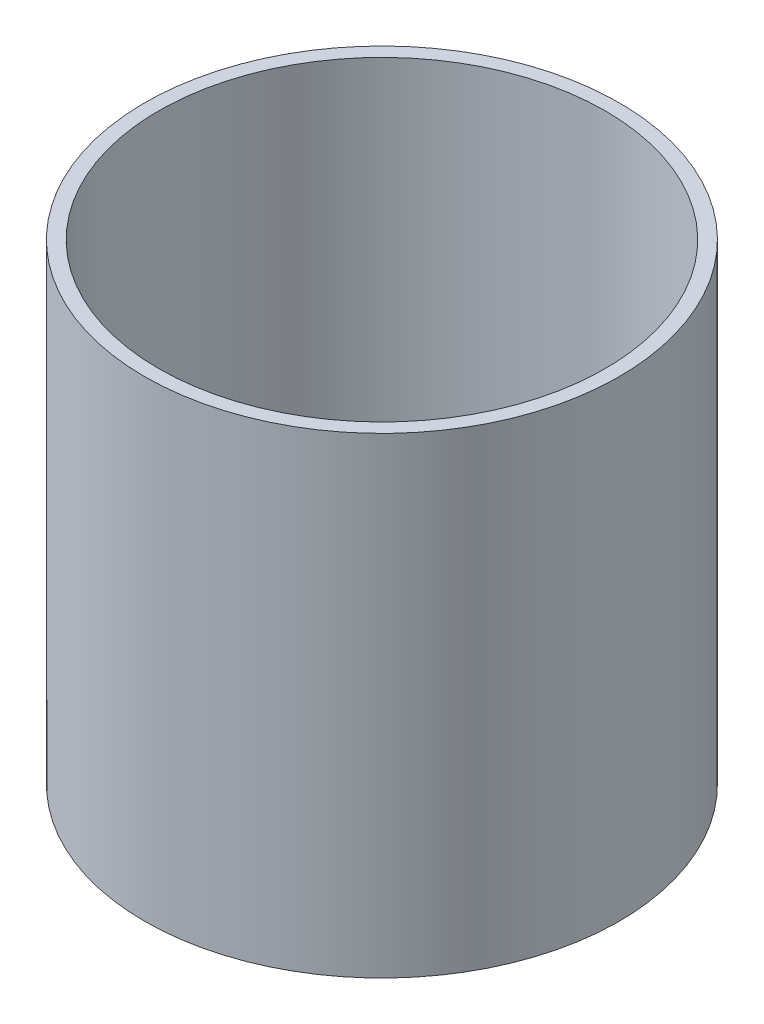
ISO-10303-21;
HEADER;
FILE_DESCRIPTION(('STEP AP214'),'2;1');
FILE_NAME('part.step','',(''),(''),'','','');
FILE_SCHEMA(('AUTOMOTIVE_DESIGN { 1 0 10303 214 1 1 1 1 }'));
ENDSEC;
DATA;
#1=APPLICATION_CONTEXT('core data for automotive mechanical design processes');
#2=APPLICATION_PROTOCOL_DEFINITION('international standard','automotive_design',2000,#1);
#3=PRODUCT_CONTEXT('',#1,'mechanical');
#4=PRODUCT('Part','Part','',(#3));
#5=PRODUCT_RELATED_PRODUCT_CATEGORY('part','',(#4));
#6=PRODUCT_DEFINITION_FORMATION('','',#4);
#7=PRODUCT_DEFINITION_CONTEXT('part definition',#1,'design');
#8=PRODUCT_DEFINITION('design','',#6,#7);
#9=PRODUCT_DEFINITION_SHAPE('','',#8);
#10=(LENGTH_UNIT() NAMED_UNIT(*) SI_UNIT(.MILLI.,.METRE.));
#11=(NAMED_UNIT(*) PLANE_ANGLE_UNIT() SI_UNIT($,.RADIAN.));
#12=(NAMED_UNIT(*) SI_UNIT($,.STERADIAN.) SOLID_ANGLE_UNIT());
#13=UNCERTAINTY_MEASURE_WITH_UNIT(LENGTH_MEASURE(1.E-05),#10,'distance_accuracy_value','');
#14=(GEOMETRIC_REPRESENTATION_CONTEXT(3) GLOBAL_UNCERTAINTY_ASSIGNED_CONTEXT((#13)) GLOBAL_UNIT_ASSIGNED_CONTEXT((#10,
#11,#12)) REPRESENTATION_CONTEXT('',''));
#15=CARTESIAN_POINT('',(0.,0.,0.));
#16=DIRECTION('',(0.,0.,1.));
#17=DIRECTION('',(1.,0.,0.));
#18=AXIS2_PLACEMENT_3D('',#15,#16,#17);
#19=CARTESIAN_POINT('',(0.,43.3301041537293,-850.));
#20=DIRECTION('',(0.,-1.,0.));
#21=DIRECTION('',(0.,0.,-1.));
#22=AXIS2_PLACEMENT_3D('',#19,#20,#21);
#23=PLANE('',#22);
#24=CARTESIAN_POINT('',(0.,43.3301041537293,0.));
#25=DIRECTION('',(0.,1.,0.));
#26=DIRECTION('',(0.,0.,1.));
#27=AXIS2_PLACEMENT_3D('',#24,#25,#26);
#28=CIRCLE('',#27,800.);
#29=CARTESIAN_POINT('',(0.,43.3301041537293,800.));
#30=VERTEX_POINT('',#29);
#31=EDGE_CURVE('E10',#30,#30,#28,.T.);
#32=ORIENTED_EDGE('',*,*,#31,.F.);
#33=EDGE_LOOP('',(#32));
#34=FACE_BOUND('',#33,.T.);
#35=CARTESIAN_POINT('',(0.,43.3301041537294,0.));
#36=DIRECTION('',(0.,1.,0.));
#37=DIRECTION('',(0.,0.,1.));
#38=AXIS2_PLACEMENT_3D('',#35,#36,#37);
#39=CIRCLE('',#38,850.);
#40=CARTESIAN_POINT('',(0.,43.3301041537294,850.));
#41=VERTEX_POINT('',#40);
#42=EDGE_CURVE('E45',#41,#41,#39,.T.);
#43=ORIENTED_EDGE('',*,*,#42,.T.);
#44=EDGE_LOOP('',(#43));
#45=FACE_BOUND('',#44,.T.);
#46=ADVANCED_FACE('F31',(#34,#45),#23,.F.);
#47=CARTESIAN_POINT('',(0.,0.,0.));
#48=DIRECTION('',(0.,1.,0.));
#49=DIRECTION('',(0.,0.,1.));
#50=AXIS2_PLACEMENT_3D('',#47,#48,#49);
#51=CYLINDRICAL_SURFACE('',#50,800.);
#52=CARTESIAN_POINT('',(0.,-1626.66989584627,0.));
#53=DIRECTION('',(0.,1.,0.));
#54=DIRECTION('',(0.,0.,1.));
#55=AXIS2_PLACEMENT_3D('',#52,#53,#54);
#56=CIRCLE('',#55,800.);
#57=CARTESIAN_POINT('',(0.,-1626.66989584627,800.));
#58=VERTEX_POINT('',#57);
#59=EDGE_CURVE('E37',#58,#58,#56,.T.);
#60=ORIENTED_EDGE('',*,*,#59,.F.);
#61=EDGE_LOOP('',(#60));
#62=FACE_BOUND('',#61,.T.);
#63=ORIENTED_EDGE('',*,*,#31,.T.);
#64=EDGE_LOOP('',(#63));
#65=FACE_BOUND('',#64,.T.);
#66=ADVANCED_FACE('F65',(#62,#65),#51,.F.);
#67=CARTESIAN_POINT('',(0.,-1626.66989584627,-1.96760314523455E-13));
#68=DIRECTION('',(0.,-1.,0.));
#69=DIRECTION('',(0.,0.,-1.));
#70=AXIS2_PLACEMENT_3D('',#67,#68,#69);
#71=PLANE('',#70);
#72=ORIENTED_EDGE('',*,*,#59,.T.);
#73=EDGE_LOOP('',(#72));
#74=FACE_BOUND('',#73,.T.);
#75=ADVANCED_FACE('F60',(#74),#71,.F.);
#76=CARTESIAN_POINT('',(0.,-1646.66989584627,-850.));
#77=DIRECTION('',(0.,1.,0.));
#78=DIRECTION('',(0.,0.,1.));
#79=AXIS2_PLACEMENT_3D('',#76,#77,#78);
#80=PLANE('',#79);
#81=CARTESIAN_POINT('',(0.,-1646.66989584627,0.));
#82=DIRECTION('',(0.,1.,0.));
#83=DIRECTION('',(0.,0.,1.));
#84=AXIS2_PLACEMENT_3D('',#81,#82,#83);
#85=CIRCLE('',#84,850.);
#86=CARTESIAN_POINT('',(0.,-1646.66989584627,850.));
#87=VERTEX_POINT('',#86);
#88=EDGE_CURVE('E41',#87,#87,#85,.T.);
#89=ORIENTED_EDGE('',*,*,#88,.F.);
#90=EDGE_LOOP('',(#89));
#91=FACE_BOUND('',#90,.T.);
#92=ADVANCED_FACE('F55',(#91),#80,.F.);
#93=CARTESIAN_POINT('',(0.,0.,0.));
#94=DIRECTION('',(0.,1.,0.));
#95=DIRECTION('',(0.,0.,1.));
#96=AXIS2_PLACEMENT_3D('',#93,#94,#95);
#97=CYLINDRICAL_SURFACE('',#96,850.);
#98=ORIENTED_EDGE('',*,*,#42,.F.);
#99=EDGE_LOOP('',(#98));
#100=FACE_BOUND('',#99,.T.);
#101=ORIENTED_EDGE('',*,*,#88,.T.);
#102=EDGE_LOOP('',(#101));
#103=FACE_BOUND('',#102,.T.);
#104=ADVANCED_FACE('F52',(#100,#103),#97,.T.);
#105=CLOSED_SHELL('',(#46,#66,#75,#92,#104));
#106=MANIFOLD_SOLID_BREP('B2',#105);
#107=ADVANCED_BREP_SHAPE_REPRESENTATION('',(#18,#106),#14);
#108=SHAPE_DEFINITION_REPRESENTATION(#9,#107);
ENDSEC;
END-ISO-10303-21;
